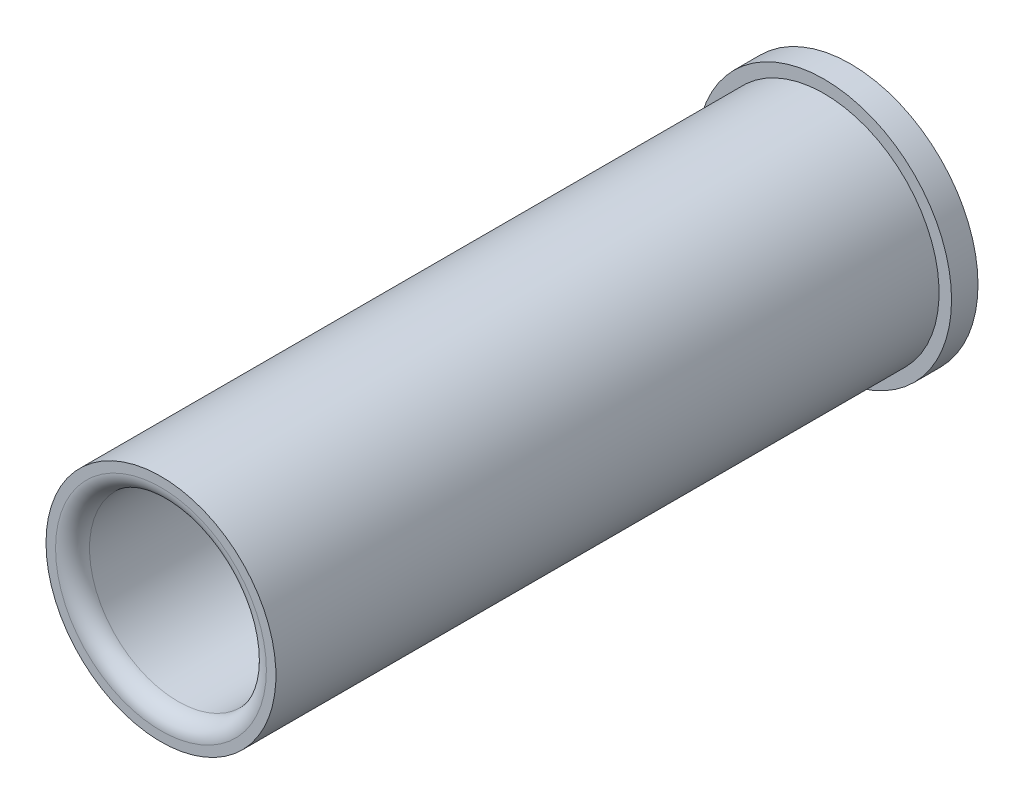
ISO-10303-21;
HEADER;
FILE_DESCRIPTION(('STEP AP214'),'2;1');
FILE_NAME('part.step','',(''),(''),'','','');
FILE_SCHEMA(('AUTOMOTIVE_DESIGN { 1 0 10303 214 1 1 1 1 }'));
ENDSEC;
DATA;
#1=APPLICATION_CONTEXT('core data for automotive mechanical design processes');
#2=APPLICATION_PROTOCOL_DEFINITION('international standard','automotive_design',2000,#1);
#3=PRODUCT_CONTEXT('',#1,'mechanical');
#4=PRODUCT('Part','Part','',(#3));
#5=PRODUCT_RELATED_PRODUCT_CATEGORY('part','',(#4));
#6=PRODUCT_DEFINITION_FORMATION('','',#4);
#7=PRODUCT_DEFINITION_CONTEXT('part definition',#1,'design');
#8=PRODUCT_DEFINITION('design','',#6,#7);
#9=PRODUCT_DEFINITION_SHAPE('','',#8);
#10=(LENGTH_UNIT() NAMED_UNIT(*) SI_UNIT(.MILLI.,.METRE.));
#11=(NAMED_UNIT(*) PLANE_ANGLE_UNIT() SI_UNIT($,.RADIAN.));
#12=(NAMED_UNIT(*) SI_UNIT($,.STERADIAN.) SOLID_ANGLE_UNIT());
#13=UNCERTAINTY_MEASURE_WITH_UNIT(LENGTH_MEASURE(1.E-05),#10,'distance_accuracy_value','');
#14=(GEOMETRIC_REPRESENTATION_CONTEXT(3) GLOBAL_UNCERTAINTY_ASSIGNED_CONTEXT((#13)) GLOBAL_UNIT_ASSIGNED_CONTEXT((#10,
#11,#12)) REPRESENTATION_CONTEXT('',''));
#15=CARTESIAN_POINT('',(0.,0.,0.));
#16=DIRECTION('',(0.,0.,1.));
#17=DIRECTION('',(1.,0.,0.));
#18=AXIS2_PLACEMENT_3D('',#15,#16,#17);
#19=CARTESIAN_POINT('',(0.,0.,123.825));
#20=DIRECTION('',(0.,0.,-1.));
#21=DIRECTION('',(-1.,0.,0.));
#22=AXIS2_PLACEMENT_3D('',#19,#20,#21);
#23=CYLINDRICAL_SURFACE('',#22,20.64385);
#24=CARTESIAN_POINT('',(0.,0.,4.7498));
#25=DIRECTION('',(0.,0.,-1.));
#26=DIRECTION('',(-1.,0.,0.));
#27=AXIS2_PLACEMENT_3D('',#24,#25,#26);
#28=CIRCLE('',#27,20.64385);
#29=CARTESIAN_POINT('',(-20.64385,0.,4.7498));
#30=VERTEX_POINT('',#29);
#31=EDGE_CURVE('E38',#30,#30,#28,.T.);
#32=ORIENTED_EDGE('',*,*,#31,.F.);
#33=EDGE_LOOP('',(#32));
#34=FACE_BOUND('',#33,.T.);
#35=CARTESIAN_POINT('',(0.,0.,123.825));
#36=DIRECTION('',(0.,0.,-1.));
#37=DIRECTION('',(-1.,0.,0.));
#38=AXIS2_PLACEMENT_3D('',#35,#36,#37);
#39=CIRCLE('',#38,20.64385);
#40=CARTESIAN_POINT('',(-20.64385,0.,123.825));
#41=VERTEX_POINT('',#40);
#42=EDGE_CURVE('E16',#41,#41,#39,.F.);
#43=ORIENTED_EDGE('',*,*,#42,.F.);
#44=EDGE_LOOP('',(#43));
#45=FACE_BOUND('',#44,.T.);
#46=ADVANCED_FACE('F12',(#34,#45),#23,.T.);
#47=CARTESIAN_POINT('',(-20.64385,-20.64385,123.825));
#48=DIRECTION('',(0.,0.,1.));
#49=DIRECTION('',(1.,0.,0.));
#50=AXIS2_PLACEMENT_3D('',#47,#48,#49);
#51=PLANE('',#50);
#52=CARTESIAN_POINT('',(0.,0.,123.825));
#53=DIRECTION('',(0.,0.,1.));
#54=DIRECTION('',(1.,0.,0.));
#55=AXIS2_PLACEMENT_3D('',#52,#53,#54);
#56=CIRCLE('',#55,18.92935);
#57=CARTESIAN_POINT('',(18.92935,0.,123.825));
#58=VERTEX_POINT('',#57);
#59=EDGE_CURVE('E36',#58,#58,#56,.T.);
#60=ORIENTED_EDGE('',*,*,#59,.F.);
#61=EDGE_LOOP('',(#60));
#62=FACE_BOUND('',#61,.T.);
#63=ORIENTED_EDGE('',*,*,#42,.T.);
#64=EDGE_LOOP('',(#63));
#65=FACE_BOUND('',#64,.T.);
#66=ADVANCED_FACE('F45',(#62,#65),#51,.T.);
#67=CARTESIAN_POINT('',(-22.8854,-22.8854,4.7498));
#68=DIRECTION('',(0.,0.,1.));
#69=DIRECTION('',(1.,0.,0.));
#70=AXIS2_PLACEMENT_3D('',#67,#68,#69);
#71=PLANE('',#70);
#72=ORIENTED_EDGE('',*,*,#31,.T.);
#73=EDGE_LOOP('',(#72));
#74=FACE_BOUND('',#73,.T.);
#75=CARTESIAN_POINT('',(0.,0.,4.7498));
#76=DIRECTION('',(0.,0.,-1.));
#77=DIRECTION('',(-1.,0.,0.));
#78=AXIS2_PLACEMENT_3D('',#75,#76,#77);
#79=CIRCLE('',#78,22.8854);
#80=CARTESIAN_POINT('',(-22.8854,0.,4.7498));
#81=VERTEX_POINT('',#80);
#82=EDGE_CURVE('E33',#81,#81,#79,.T.);
#83=ORIENTED_EDGE('',*,*,#82,.F.);
#84=EDGE_LOOP('',(#83));
#85=FACE_BOUND('',#84,.T.);
#86=ADVANCED_FACE('F54',(#74,#85),#71,.T.);
#87=CARTESIAN_POINT('',(0.,0.,120.777));
#88=DIRECTION('',(0.,0.,1.));
#89=DIRECTION('',(1.,0.,0.));
#90=AXIS2_PLACEMENT_3D('',#87,#88,#89);
#91=TOROIDAL_SURFACE('',#90,18.92935,3.04800000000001);
#92=ORIENTED_EDGE('',*,*,#59,.T.);
#93=EDGE_LOOP('',(#92));
#94=FACE_BOUND('',#93,.T.);
#95=CARTESIAN_POINT('',(0.,0.,120.777));
#96=DIRECTION('',(0.,0.,1.));
#97=DIRECTION('',(0.,-1.,0.));
#98=AXIS2_PLACEMENT_3D('',#95,#96,#97);
#99=CIRCLE('',#98,15.88135);
#100=CARTESIAN_POINT('',(0.,-15.88135,120.777));
#101=VERTEX_POINT('',#100);
#102=EDGE_CURVE('E30',#101,#101,#99,.T.);
#103=ORIENTED_EDGE('',*,*,#102,.F.);
#104=EDGE_LOOP('',(#103));
#105=FACE_BOUND('',#104,.T.);
#106=ADVANCED_FACE('F73',(#94,#105),#91,.T.);
#107=CARTESIAN_POINT('',(0.,0.,4.7498));
#108=DIRECTION('',(0.,0.,-1.));
#109=DIRECTION('',(-1.,0.,0.));
#110=AXIS2_PLACEMENT_3D('',#107,#108,#109);
#111=CYLINDRICAL_SURFACE('',#110,22.8854);
#112=ORIENTED_EDGE('',*,*,#82,.T.);
#113=EDGE_LOOP('',(#112));
#114=FACE_BOUND('',#113,.T.);
#115=CARTESIAN_POINT('',(0.,0.,0.));
#116=DIRECTION('',(0.,0.,-1.));
#117=DIRECTION('',(-1.,0.,0.));
#118=AXIS2_PLACEMENT_3D('',#115,#116,#117);
#119=CIRCLE('',#118,22.8854);
#120=CARTESIAN_POINT('',(-22.8854,0.,0.));
#121=VERTEX_POINT('',#120);
#122=EDGE_CURVE('E25',#121,#121,#119,.T.);
#123=ORIENTED_EDGE('',*,*,#122,.F.);
#124=EDGE_LOOP('',(#123));
#125=FACE_BOUND('',#124,.T.);
#126=ADVANCED_FACE('F69',(#114,#125),#111,.T.);
#127=CARTESIAN_POINT('',(0.,0.,0.762000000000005));
#128=DIRECTION('',(0.,0.,1.));
#129=DIRECTION('',(0.,-1.,0.));
#130=AXIS2_PLACEMENT_3D('',#127,#128,#129);
#131=CYLINDRICAL_SURFACE('',#130,15.88135);
#132=CARTESIAN_POINT('',(0.,0.,0.76200000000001));
#133=DIRECTION('',(0.,0.,-1.));
#134=DIRECTION('',(0.,1.,0.));
#135=AXIS2_PLACEMENT_3D('',#132,#133,#134);
#136=CIRCLE('',#135,15.88135);
#137=CARTESIAN_POINT('',(0.,15.88135,0.76200000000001));
#138=VERTEX_POINT('',#137);
#139=EDGE_CURVE('E20',#138,#138,#136,.F.);
#140=ORIENTED_EDGE('',*,*,#139,.F.);
#141=EDGE_LOOP('',(#140));
#142=FACE_BOUND('',#141,.T.);
#143=ORIENTED_EDGE('',*,*,#102,.T.);
#144=EDGE_LOOP('',(#143));
#145=FACE_BOUND('',#144,.T.);
#146=ADVANCED_FACE('F62',(#142,#145),#131,.F.);
#147=CARTESIAN_POINT('',(22.8854,-23.4765583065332,0.));
#148=DIRECTION('',(0.,0.,-1.));
#149=DIRECTION('',(-1.,0.,0.));
#150=AXIS2_PLACEMENT_3D('',#147,#148,#149);
#151=PLANE('',#150);
#152=CARTESIAN_POINT('',(0.,0.,0.));
#153=DIRECTION('',(0.,0.,-1.));
#154=DIRECTION('',(0.,1.,0.));
#155=AXIS2_PLACEMENT_3D('',#152,#153,#154);
#156=CIRCLE('',#155,16.64335);
#157=CARTESIAN_POINT('',(0.,16.64335,0.));
#158=VERTEX_POINT('',#157);
#159=EDGE_CURVE('E8',#158,#158,#156,.T.);
#160=ORIENTED_EDGE('',*,*,#159,.F.);
#161=EDGE_LOOP('',(#160));
#162=FACE_BOUND('',#161,.T.);
#163=ORIENTED_EDGE('',*,*,#122,.T.);
#164=EDGE_LOOP('',(#163));
#165=FACE_BOUND('',#164,.T.);
#166=ADVANCED_FACE('F58',(#162,#165),#151,.T.);
#167=CARTESIAN_POINT('',(0.,0.,0.762000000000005));
#168=DIRECTION('',(0.,0.,-1.));
#169=DIRECTION('',(0.,1.,0.));
#170=AXIS2_PLACEMENT_3D('',#167,#168,#169);
#171=CONICAL_SURFACE('',#170,15.88135,0.785398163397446);
#172=ORIENTED_EDGE('',*,*,#159,.T.);
#173=EDGE_LOOP('',(#172));
#174=FACE_BOUND('',#173,.T.);
#175=ORIENTED_EDGE('',*,*,#139,.T.);
#176=EDGE_LOOP('',(#175));
#177=FACE_BOUND('',#176,.T.);
#178=ADVANCED_FACE('F14',(#174,#177),#171,.F.);
#179=CLOSED_SHELL('',(#46,#66,#86,#106,#126,#146,#166,#178));
#180=MANIFOLD_SOLID_BREP('B1',#179);
#181=ADVANCED_BREP_SHAPE_REPRESENTATION('',(#18,#180),#14);
#182=SHAPE_DEFINITION_REPRESENTATION(#9,#181);
ENDSEC;
END-ISO-10303-21;
